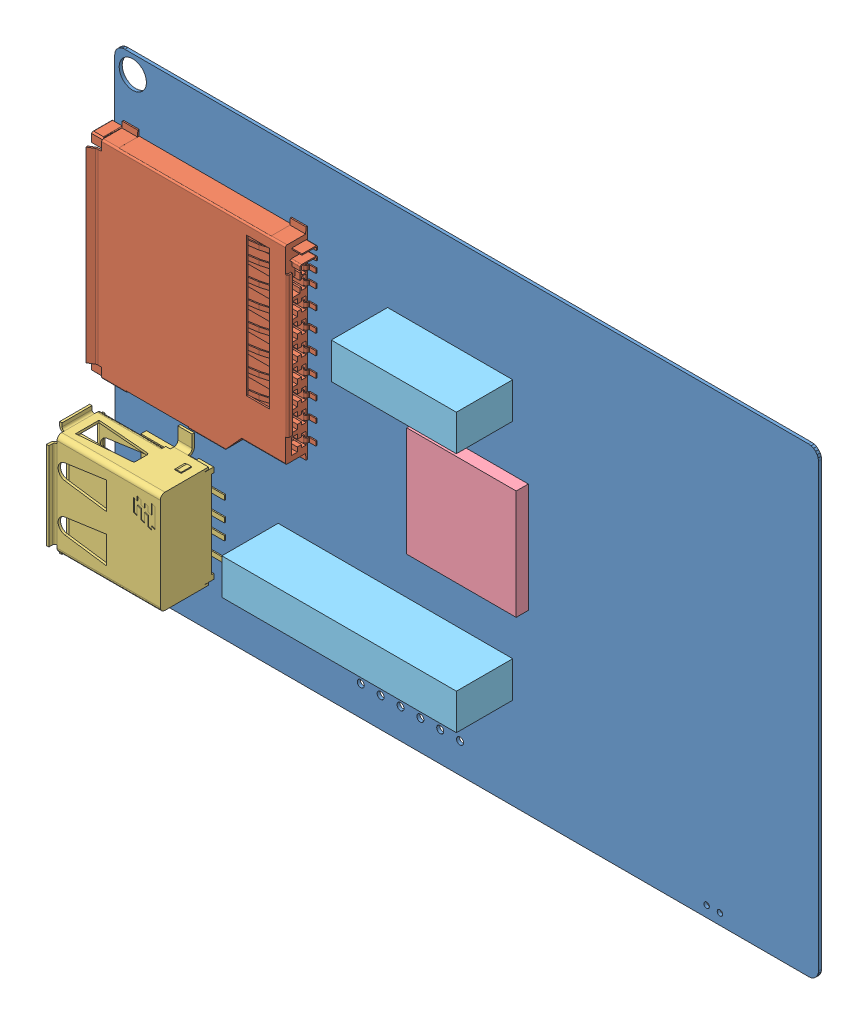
SolidWorks assembly Screen207V1.SLDASM, configuration 默认 (file format 9000). Lengths in mm.
Overall size (91.01 59.02 8.79).
9 component instances, 5 part files, 4 mates.
Components (placement in the parent):
- Board_1-1: Board_1.sldprt [默认] at (0 0 -0.3912) size (90.02 59.02 0.39)
- U13-1: U13.sldasm [默认] at origin size (26.36 28.03 4.15)
  - sd_big_1-1: sd_big_1.sldprt [默认] at (-0.3817 37.0464 0) x (0 -1 0) z (-1 0 0) size (28.03 4.15 26.36)
- U_DISK-1: U_DISK.sldasm [默认] at (0 0 -0.07) size (15.16 17.26 8.79)
  - USBA_1-1: USBA_1.sldprt [默认] at (-1.0035 12.3441 4.2) x (0 -1 0) z (-1 0 0) size (17.26 8.79 15.16)
- U3-1: U3.sldasm [默认] at origin size (14 14 1.55)
  - 487667936-1: 487667936.sldasm [默认] at (45.941 29.6954 0.05) size (14 14 1.55)
    - Extruded_1-1: Extruded_1.sldprt [默认] at origin size (14 14 1.55)
- 插座-1: 插座.SLDPRT [默认] at (20.898 11.6917 0) x (1 0.000194 0) z (0.000194 -1 0) size (30 7.2 35.5)
Mates (geometry in assembly coordinates):
- 重合1: coincident anti-aligned: plane of Board_1-1 through (-0.011 1.27 0) normal (0 0 1); plane of U_DISK-1/USBA_1-1 through (8.3665 5.2741 0) normal (0 0 -1)
- 重合2: coincident anti-aligned: plane of Board_1-1 through (-0.011 1.27 0) normal (0 0 1); plane of U13-1/sd_big_1-1 through (12.0226 37.2888 0) normal (0 0 -1)
- 重合3: coincident: plane of Board_1-1 through (-0.011 1.27 0) normal (0 0 1); plane of 插座-1 through (18.7155 11.6912 0) normal (0 0 -1)
- 距离4: distance = 20.9 mm: plane of 插座-1 through (20.898 11.6917 7.2) normal (-1 -0.000194 0); line of Board_1-1 through (56.46 0 1.27) axis (0 -0.000194 1)
